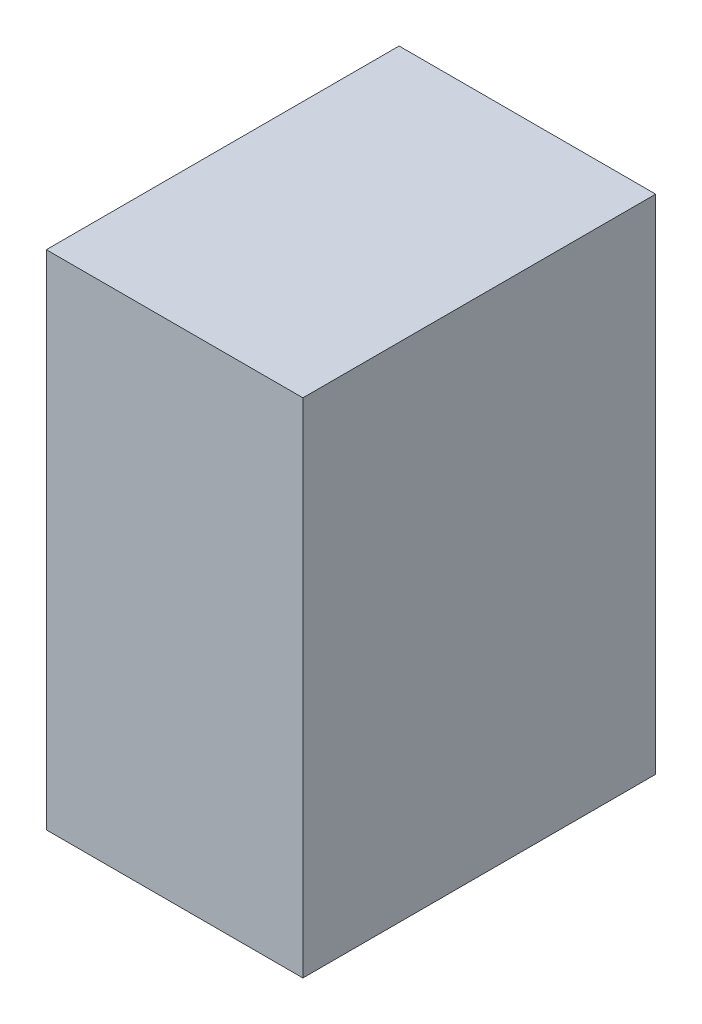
from build123d import *

# Parameters (mm, degrees)
SKETCH_1_W      = 240
SKETCH_1_H      = 470
EXTRUDE_1_DEPTH = 330


with BuildPart() as part:
    # Sketch 1 → Extrude 1 (new body)
    with BuildSketch(Plane.XY):
        with Locations((0, -5)):
            Rectangle(SKETCH_1_W, SKETCH_1_H)
    extrude(amount=EXTRUDE_1_DEPTH)


solid = part.part
